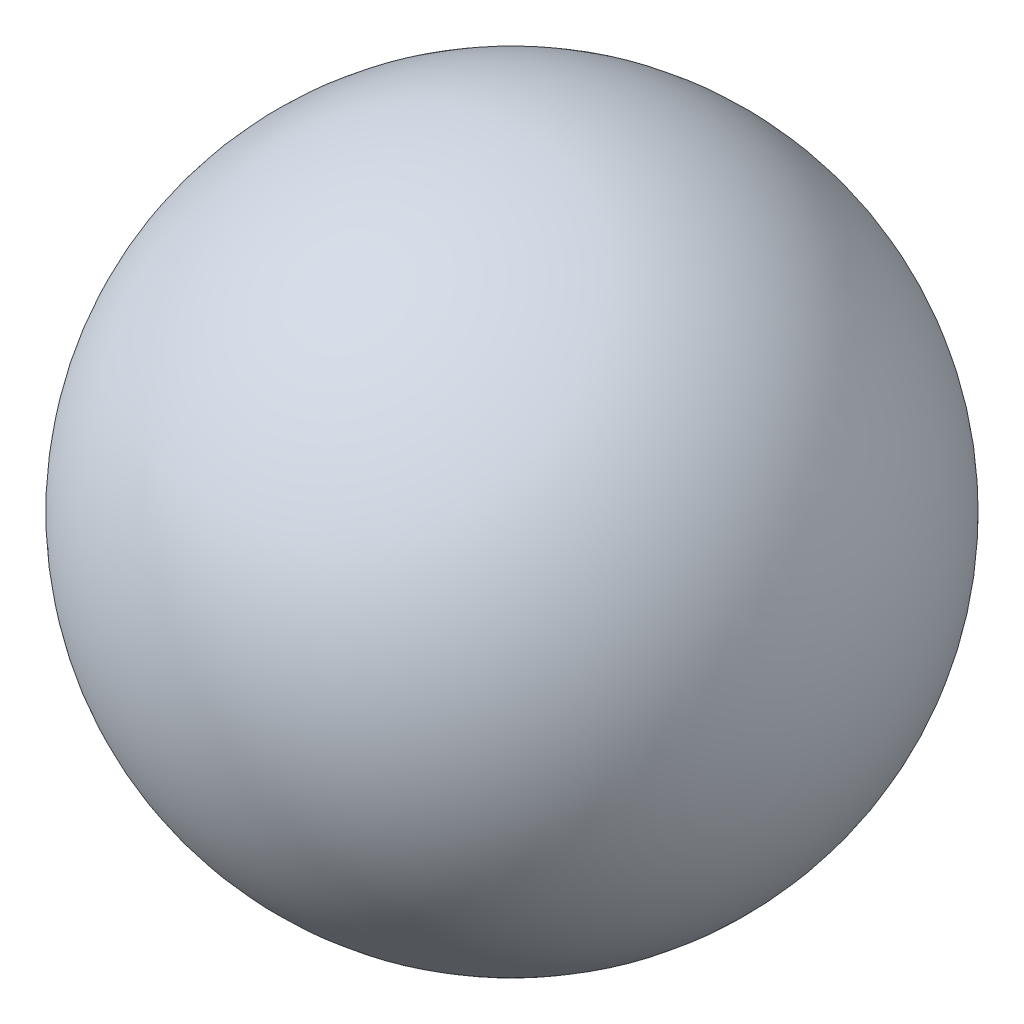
from build123d import *


with BuildPart() as part:
    # Sketch1 → Revolve1 (revolve)
    with BuildSketch(Plane.XY):
        with BuildLine():
            Line((0, 64), (0, 67.5))
            ThreePointArc((0, 67.5), (67.076731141, 7.547326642), (15, -65.812232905))
            Line((15, -65.812232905), (15, -62.217360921))
            ThreePointArc((15, -62.217360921), (63.552777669, 7.552777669), (0, 64))
        make_face()
    revolve(axis=Axis((0, -64, 0), (0, 1, 0)))


solid = part.part
